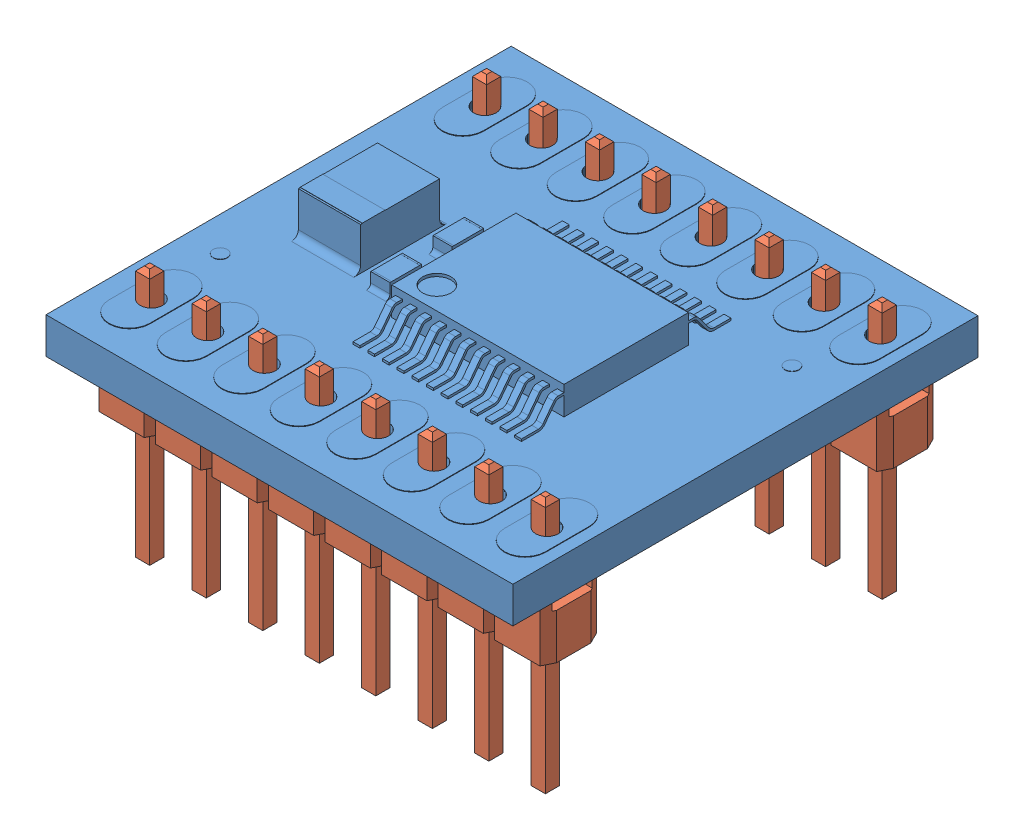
SolidWorks assembly Assem1.SLDASM, configuration Default (file format 13000). Lengths in mm.
Overall size (20.98 12.11 20.9).
3 component instances, 2 part files, 8 mates.
Components (placement in the parent):
- Motor_driver-1: Motor_driver.SLDPRT [Default] at (9.9405 7.809 16.8576) x (0 1 0) z (0 0 1) size (3.57 20.98 20.9)
- 8_pin_header-1: 8_pin_header.SLDPRT [Default] at (10.1183 6.5136 24.4251) x (-1 0 0) z (0 0 1) size (20.32 11.54 2.54)
- 8_pin_header-2: 8_pin_header.SLDPRT [Default] at (10.1183 6.5136 9.2901) x (1 0 0) z (0 0 -1) size (20.32 11.54 2.54)
Mates (geometry in assembly coordinates):
- Coincident1: coincident: plane of Motor_driver-1 through (1.2283 7.7836 25.3412) normal (0 -1 0); plane of 8_pin_header-1 through (0.0352 7.7836 23.2067) normal (0 1 0)
- Parallel1: parallel: plane of Motor_driver-1 through (-0.5497 9.4346 27.3097) normal (0 0 1); plane of 8_pin_header-1 through (0.0352 7.7836 25.7467) normal (0 0 1)
- Coincident4: coincident: cylinder of Motor_driver-1 through (1.2283 7.809 24.3506) axis (0 1 0) radius 0.508; line of 8_pin_header-1 through (0.9083 -0.5564 24.7451) axis (0 1 0)
- Coincident5: coincident: cylinder of Motor_driver-1 through (1.2283 7.809 24.3506) axis (0 1 0) radius 0.508; line of 8_pin_header-1 through (1.5483 -0.5564 24.7451) axis (0 1 0)
- Parallel2: parallel: plane of Motor_driver-1 through (-0.5497 9.4346 6.4055) normal (0 0 -1); plane of 8_pin_header-2 through (20.2783 7.7836 8.0201) normal (0 0 -1)
- Coincident7: coincident: plane of Motor_driver-1 through (19.0083 7.7836 10.3552) normal (0 -1 0); plane of 8_pin_header-2 through (20.2783 7.7836 10.5601) normal (0 1 0)
- Coincident8: coincident: cylinder of Motor_driver-1 through (19.0083 7.7836 9.3646) axis (0 1 0) radius 0.508; line of 8_pin_header-2 through (19.3283 -0.5564 8.9701) axis (0 1 0)
- Coincident9: coincident: cylinder of Motor_driver-1 through (19.0083 7.7836 9.3646) axis (0 1 0) radius 0.508; line of 8_pin_header-2 through (18.6883 -0.5564 8.9701) axis (0 1 0)
